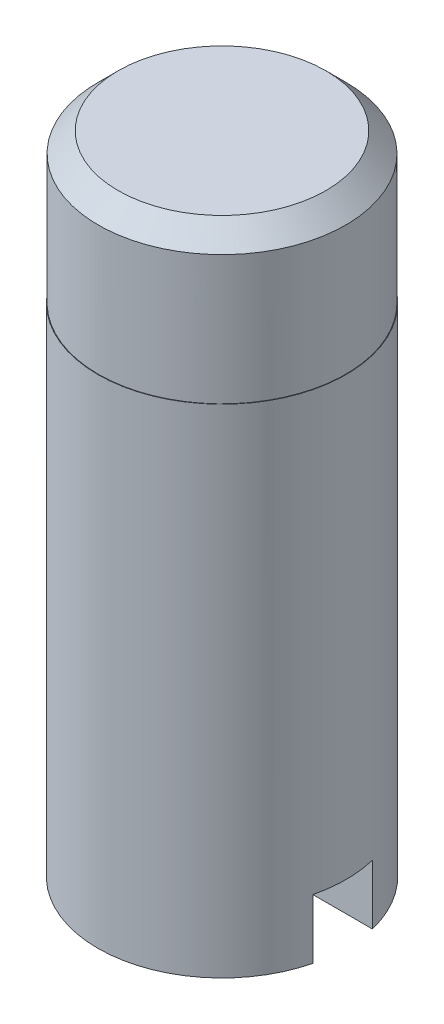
ISO-10303-21;
HEADER;
FILE_DESCRIPTION(('STEP AP214'),'2;1');
FILE_NAME('part.step','',(''),(''),'','','');
FILE_SCHEMA(('AUTOMOTIVE_DESIGN { 1 0 10303 214 1 1 1 1 }'));
ENDSEC;
DATA;
#1=APPLICATION_CONTEXT('core data for automotive mechanical design processes');
#2=APPLICATION_PROTOCOL_DEFINITION('international standard','automotive_design',2000,#1);
#3=PRODUCT_CONTEXT('',#1,'mechanical');
#4=PRODUCT('Part','Part','',(#3));
#5=PRODUCT_RELATED_PRODUCT_CATEGORY('part','',(#4));
#6=PRODUCT_DEFINITION_FORMATION('','',#4);
#7=PRODUCT_DEFINITION_CONTEXT('part definition',#1,'design');
#8=PRODUCT_DEFINITION('design','',#6,#7);
#9=PRODUCT_DEFINITION_SHAPE('','',#8);
#10=(LENGTH_UNIT() NAMED_UNIT(*) SI_UNIT(.MILLI.,.METRE.));
#11=(NAMED_UNIT(*) PLANE_ANGLE_UNIT() SI_UNIT($,.RADIAN.));
#12=(NAMED_UNIT(*) SI_UNIT($,.STERADIAN.) SOLID_ANGLE_UNIT());
#13=UNCERTAINTY_MEASURE_WITH_UNIT(LENGTH_MEASURE(1.E-05),#10,'distance_accuracy_value','');
#14=(GEOMETRIC_REPRESENTATION_CONTEXT(3) GLOBAL_UNCERTAINTY_ASSIGNED_CONTEXT((#13)) GLOBAL_UNIT_ASSIGNED_CONTEXT((#10,
#11,#12)) REPRESENTATION_CONTEXT('',''));
#15=CARTESIAN_POINT('',(0.,0.,0.));
#16=DIRECTION('',(0.,0.,1.));
#17=DIRECTION('',(1.,0.,0.));
#18=AXIS2_PLACEMENT_3D('',#15,#16,#17);
#19=CARTESIAN_POINT('',(0.,0.,0.));
#20=DIRECTION('',(0.,1.,0.));
#21=DIRECTION('',(0.,0.,1.));
#22=AXIS2_PLACEMENT_3D('',#19,#20,#21);
#23=PLANE('',#22);
#24=CARTESIAN_POINT('',(0.,0.,0.));
#25=DIRECTION('',(0.,1.,0.));
#26=DIRECTION('',(0.,0.,1.));
#27=AXIS2_PLACEMENT_3D('',#24,#25,#26);
#28=CIRCLE('',#27,2.5);
#29=CARTESIAN_POINT('',(-2.42693221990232,0.,0.6));
#30=VERTEX_POINT('',#29);
#31=CARTESIAN_POINT('',(2.42693221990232,0.,0.6));
#32=VERTEX_POINT('',#31);
#33=EDGE_CURVE('E93',#30,#32,#28,.T.);
#34=ORIENTED_EDGE('',*,*,#33,.F.);
#35=DIRECTION('',(1.,0.,0.));
#36=VECTOR('',#35,1.);
#37=CARTESIAN_POINT('',(0.,0.,0.6));
#38=LINE('',#37,#36);
#39=EDGE_CURVE('E80',#30,#32,#38,.T.);
#40=ORIENTED_EDGE('',*,*,#39,.T.);
#41=EDGE_LOOP('',(#34,#40));
#42=FACE_BOUND('',#41,.T.);
#43=ADVANCED_FACE('F32',(#42),#23,.F.);
#44=CARTESIAN_POINT('',(0.,10.,0.));
#45=DIRECTION('',(0.,1.,0.));
#46=DIRECTION('',(0.,0.,1.));
#47=AXIS2_PLACEMENT_3D('',#44,#45,#46);
#48=PLANE('',#47);
#49=CARTESIAN_POINT('',(0.,10.,0.));
#50=DIRECTION('',(0.,1.,0.));
#51=DIRECTION('',(0.,0.,1.));
#52=AXIS2_PLACEMENT_3D('',#49,#50,#51);
#53=CIRCLE('',#52,2.5);
#54=CARTESIAN_POINT('',(0.,10.,2.5));
#55=VERTEX_POINT('',#54);
#56=EDGE_CURVE('E81',#55,#55,#53,.T.);
#57=ORIENTED_EDGE('',*,*,#56,.T.);
#58=EDGE_LOOP('',(#57));
#59=FACE_BOUND('',#58,.T.);
#60=CARTESIAN_POINT('',(0.,10.,0.));
#61=DIRECTION('',(0.,1.,0.));
#62=DIRECTION('',(0.,0.,1.));
#63=AXIS2_PLACEMENT_3D('',#60,#61,#62);
#64=CIRCLE('',#63,2.49);
#65=CARTESIAN_POINT('',(0.,10.,2.49));
#66=VERTEX_POINT('',#65);
#67=EDGE_CURVE('E97',#66,#66,#64,.T.);
#68=ORIENTED_EDGE('',*,*,#67,.F.);
#69=EDGE_LOOP('',(#68));
#70=FACE_BOUND('',#69,.T.);
#71=ADVANCED_FACE('F120',(#59,#70),#48,.T.);
#72=CARTESIAN_POINT('',(0.,10.,0.));
#73=DIRECTION('',(0.,-1.,0.));
#74=DIRECTION('',(0.,0.,-1.));
#75=AXIS2_PLACEMENT_3D('',#72,#73,#74);
#76=CYLINDRICAL_SURFACE('',#75,2.5);
#77=ORIENTED_EDGE('',*,*,#33,.T.);
#78=DIRECTION('',(0.,-1.,0.));
#79=VECTOR('',#78,1.);
#80=CARTESIAN_POINT('',(2.42693221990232,10.,0.6));
#81=LINE('',#80,#79);
#82=CARTESIAN_POINT('',(2.42693221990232,1.2,0.6));
#83=VERTEX_POINT('',#82);
#84=EDGE_CURVE('E90',#32,#83,#81,.F.);
#85=ORIENTED_EDGE('',*,*,#84,.T.);
#86=CARTESIAN_POINT('',(0.,1.2,0.));
#87=DIRECTION('',(0.,-1.,0.));
#88=DIRECTION('',(0.,0.,-1.));
#89=AXIS2_PLACEMENT_3D('',#86,#87,#88);
#90=CIRCLE('',#89,2.5);
#91=CARTESIAN_POINT('',(2.42693221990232,1.2,-0.6));
#92=VERTEX_POINT('',#91);
#93=EDGE_CURVE('E89',#92,#83,#90,.T.);
#94=ORIENTED_EDGE('',*,*,#93,.F.);
#95=DIRECTION('',(0.,-1.,0.));
#96=VECTOR('',#95,1.);
#97=CARTESIAN_POINT('',(2.42693221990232,10.,-0.6));
#98=LINE('',#97,#96);
#99=CARTESIAN_POINT('',(2.42693221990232,0.,-0.6));
#100=VERTEX_POINT('',#99);
#101=EDGE_CURVE('E75',#92,#100,#98,.T.);
#102=ORIENTED_EDGE('',*,*,#101,.T.);
#103=CARTESIAN_POINT('',(-2.42693221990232,0.,-0.6));
#104=VERTEX_POINT('',#103);
#105=EDGE_CURVE('E87',#100,#104,#28,.T.);
#106=ORIENTED_EDGE('',*,*,#105,.T.);
#107=DIRECTION('',(0.,-1.,0.));
#108=VECTOR('',#107,1.);
#109=CARTESIAN_POINT('',(-2.42693221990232,10.,-0.6));
#110=LINE('',#109,#108);
#111=CARTESIAN_POINT('',(-2.42693221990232,1.2,-0.6));
#112=VERTEX_POINT('',#111);
#113=EDGE_CURVE('E47',#104,#112,#110,.F.);
#114=ORIENTED_EDGE('',*,*,#113,.T.);
#115=CARTESIAN_POINT('',(-2.42693221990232,1.2,0.6));
#116=VERTEX_POINT('',#115);
#117=EDGE_CURVE('E103',#116,#112,#90,.T.);
#118=ORIENTED_EDGE('',*,*,#117,.F.);
#119=DIRECTION('',(0.,-1.,0.));
#120=VECTOR('',#119,1.);
#121=CARTESIAN_POINT('',(-2.42693221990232,10.,0.6));
#122=LINE('',#121,#120);
#123=EDGE_CURVE('E55',#116,#30,#122,.T.);
#124=ORIENTED_EDGE('',*,*,#123,.T.);
#125=EDGE_LOOP('',(#77,#85,#94,#102,#106,#114,#118,#124));
#126=FACE_BOUND('',#125,.T.);
#127=ORIENTED_EDGE('',*,*,#56,.F.);
#128=EDGE_LOOP('',(#127));
#129=FACE_BOUND('',#128,.T.);
#130=ADVANCED_FACE('F34',(#126,#129),#76,.T.);
#131=ORIENTED_EDGE('',*,*,#105,.F.);
#132=DIRECTION('',(-1.,0.,0.));
#133=VECTOR('',#132,1.);
#134=CARTESIAN_POINT('',(0.,0.,-0.6));
#135=LINE('',#134,#133);
#136=EDGE_CURVE('E72',#100,#104,#135,.T.);
#137=ORIENTED_EDGE('',*,*,#136,.T.);
#138=EDGE_LOOP('',(#131,#137));
#139=FACE_BOUND('',#138,.T.);
#140=ADVANCED_FACE('F92',(#139),#23,.F.);
#141=CARTESIAN_POINT('',(0.,13.,0.));
#142=DIRECTION('',(0.,-1.,0.));
#143=DIRECTION('',(0.,0.,-1.));
#144=AXIS2_PLACEMENT_3D('',#141,#142,#143);
#145=CYLINDRICAL_SURFACE('',#144,2.49);
#146=CARTESIAN_POINT('',(0.,12.6,0.));
#147=DIRECTION('',(0.,1.,0.));
#148=DIRECTION('',(0.,0.,1.));
#149=AXIS2_PLACEMENT_3D('',#146,#147,#148);
#150=CIRCLE('',#149,2.49);
#151=CARTESIAN_POINT('',(0.,12.6,-2.49));
#152=VERTEX_POINT('',#151);
#153=EDGE_CURVE('E11',#152,#152,#150,.F.);
#154=ORIENTED_EDGE('',*,*,#153,.T.);
#155=EDGE_LOOP('',(#154));
#156=FACE_BOUND('',#155,.T.);
#157=ORIENTED_EDGE('',*,*,#67,.T.);
#158=EDGE_LOOP('',(#157));
#159=FACE_BOUND('',#158,.T.);
#160=ADVANCED_FACE('F128',(#156,#159),#145,.T.);
#161=CARTESIAN_POINT('',(0.,13.,0.));
#162=DIRECTION('',(0.,1.,0.));
#163=DIRECTION('',(0.,0.,1.));
#164=AXIS2_PLACEMENT_3D('',#161,#162,#163);
#165=PLANE('',#164);
#166=CARTESIAN_POINT('',(0.,13.,0.));
#167=DIRECTION('',(0.,1.,0.));
#168=DIRECTION('',(0.,0.,1.));
#169=AXIS2_PLACEMENT_3D('',#166,#167,#168);
#170=CIRCLE('',#169,2.09);
#171=CARTESIAN_POINT('',(0.,13.,-2.09));
#172=VERTEX_POINT('',#171);
#173=EDGE_CURVE('E40',#172,#172,#170,.T.);
#174=ORIENTED_EDGE('',*,*,#173,.T.);
#175=EDGE_LOOP('',(#174));
#176=FACE_BOUND('',#175,.T.);
#177=ADVANCED_FACE('F133',(#176),#165,.T.);
#178=CARTESIAN_POINT('',(-6.07180887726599,1.2,-0.6));
#179=DIRECTION('',(0.,-1.,0.));
#180=DIRECTION('',(0.,0.,-1.));
#181=AXIS2_PLACEMENT_3D('',#178,#179,#180);
#182=PLANE('',#181);
#183=ORIENTED_EDGE('',*,*,#93,.T.);
#184=DIRECTION('',(-1.,0.,0.));
#185=VECTOR('',#184,1.);
#186=CARTESIAN_POINT('',(-6.07180887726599,1.2,0.6));
#187=LINE('',#186,#185);
#188=EDGE_CURVE('E109',#83,#116,#187,.T.);
#189=ORIENTED_EDGE('',*,*,#188,.T.);
#190=ORIENTED_EDGE('',*,*,#117,.T.);
#191=DIRECTION('',(1.,0.,0.));
#192=VECTOR('',#191,1.);
#193=CARTESIAN_POINT('',(-6.07180887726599,1.2,-0.6));
#194=LINE('',#193,#192);
#195=EDGE_CURVE('E111',#112,#92,#194,.T.);
#196=ORIENTED_EDGE('',*,*,#195,.T.);
#197=EDGE_LOOP('',(#183,#189,#190,#196));
#198=FACE_BOUND('',#197,.T.);
#199=ADVANCED_FACE('F108',(#198),#182,.T.);
#200=CARTESIAN_POINT('',(-6.07180887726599,1.2,0.6));
#201=DIRECTION('',(0.,0.,1.));
#202=DIRECTION('',(1.,0.,0.));
#203=AXIS2_PLACEMENT_3D('',#200,#201,#202);
#204=PLANE('',#203);
#205=ORIENTED_EDGE('',*,*,#188,.F.);
#206=ORIENTED_EDGE('',*,*,#84,.F.);
#207=ORIENTED_EDGE('',*,*,#39,.F.);
#208=ORIENTED_EDGE('',*,*,#123,.F.);
#209=EDGE_LOOP('',(#205,#206,#207,#208));
#210=FACE_BOUND('',#209,.T.);
#211=ADVANCED_FACE('F112',(#210),#204,.F.);
#212=CARTESIAN_POINT('',(-6.07180887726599,1.2,-0.6));
#213=DIRECTION('',(0.,0.,-1.));
#214=DIRECTION('',(-1.,0.,0.));
#215=AXIS2_PLACEMENT_3D('',#212,#213,#214);
#216=PLANE('',#215);
#217=ORIENTED_EDGE('',*,*,#195,.F.);
#218=ORIENTED_EDGE('',*,*,#113,.F.);
#219=ORIENTED_EDGE('',*,*,#136,.F.);
#220=ORIENTED_EDGE('',*,*,#101,.F.);
#221=EDGE_LOOP('',(#217,#218,#219,#220));
#222=FACE_BOUND('',#221,.T.);
#223=ADVANCED_FACE('F74',(#222),#216,.F.);
#224=CARTESIAN_POINT('',(0.,13.,0.));
#225=DIRECTION('',(0.,-1.,0.));
#226=DIRECTION('',(0.,0.,-1.));
#227=AXIS2_PLACEMENT_3D('',#224,#225,#226);
#228=CONICAL_SURFACE('',#227,2.09,0.785398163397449);
#229=CARTESIAN_POINT('',(0.,12.6,-2.49));
#230=CARTESIAN_POINT('',(0.,12.6041666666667,-2.48583333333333));
#231=CARTESIAN_POINT('',(0.,12.6083333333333,-2.48166666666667));
#232=CARTESIAN_POINT('',(0.,12.6166666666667,-2.47333333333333));
#233=CARTESIAN_POINT('',(0.,12.6208333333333,-2.46916666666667));
#234=CARTESIAN_POINT('',(0.,12.6291666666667,-2.46083333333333));
#235=CARTESIAN_POINT('',(0.,12.6333333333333,-2.45666666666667));
#236=CARTESIAN_POINT('',(0.,12.6416666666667,-2.44833333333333));
#237=CARTESIAN_POINT('',(0.,12.6458333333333,-2.44416666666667));
#238=CARTESIAN_POINT('',(0.,12.6541666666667,-2.43583333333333));
#239=CARTESIAN_POINT('',(0.,12.6583333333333,-2.43166666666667));
#240=CARTESIAN_POINT('',(0.,12.6666666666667,-2.42333333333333));
#241=CARTESIAN_POINT('',(0.,12.6708333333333,-2.41916666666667));
#242=CARTESIAN_POINT('',(0.,12.6791666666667,-2.41083333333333));
#243=CARTESIAN_POINT('',(0.,12.6833333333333,-2.40666666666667));
#244=CARTESIAN_POINT('',(0.,12.6916666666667,-2.39833333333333));
#245=CARTESIAN_POINT('',(0.,12.6958333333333,-2.39416666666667));
#246=CARTESIAN_POINT('',(0.,12.7041666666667,-2.38583333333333));
#247=CARTESIAN_POINT('',(0.,12.7083333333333,-2.38166666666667));
#248=CARTESIAN_POINT('',(0.,12.7166666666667,-2.37333333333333));
#249=CARTESIAN_POINT('',(0.,12.7208333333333,-2.36916666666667));
#250=CARTESIAN_POINT('',(0.,12.7291666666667,-2.36083333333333));
#251=CARTESIAN_POINT('',(0.,12.7333333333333,-2.35666666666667));
#252=CARTESIAN_POINT('',(0.,12.7416666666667,-2.34833333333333));
#253=CARTESIAN_POINT('',(0.,12.7458333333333,-2.34416666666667));
#254=CARTESIAN_POINT('',(0.,12.7541666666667,-2.33583333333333));
#255=CARTESIAN_POINT('',(0.,12.7583333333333,-2.33166666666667));
#256=CARTESIAN_POINT('',(0.,12.7666666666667,-2.32333333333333));
#257=CARTESIAN_POINT('',(0.,12.7708333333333,-2.31916666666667));
#258=CARTESIAN_POINT('',(0.,12.7791666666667,-2.31083333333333));
#259=CARTESIAN_POINT('',(0.,12.7833333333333,-2.30666666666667));
#260=CARTESIAN_POINT('',(0.,12.7916666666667,-2.29833333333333));
#261=CARTESIAN_POINT('',(0.,12.7958333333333,-2.29416666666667));
#262=CARTESIAN_POINT('',(0.,12.8041666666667,-2.28583333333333));
#263=CARTESIAN_POINT('',(0.,12.8083333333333,-2.28166666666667));
#264=CARTESIAN_POINT('',(0.,12.8166666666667,-2.27333333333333));
#265=CARTESIAN_POINT('',(0.,12.8208333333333,-2.26916666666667));
#266=CARTESIAN_POINT('',(0.,12.8291666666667,-2.26083333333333));
#267=CARTESIAN_POINT('',(0.,12.8333333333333,-2.25666666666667));
#268=CARTESIAN_POINT('',(0.,12.8416666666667,-2.24833333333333));
#269=CARTESIAN_POINT('',(0.,12.8458333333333,-2.24416666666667));
#270=CARTESIAN_POINT('',(0.,12.8541666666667,-2.23583333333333));
#271=CARTESIAN_POINT('',(0.,12.8583333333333,-2.23166666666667));
#272=CARTESIAN_POINT('',(0.,12.8666666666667,-2.22333333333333));
#273=CARTESIAN_POINT('',(0.,12.8708333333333,-2.21916666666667));
#274=CARTESIAN_POINT('',(0.,12.8791666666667,-2.21083333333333));
#275=CARTESIAN_POINT('',(0.,12.8833333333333,-2.20666666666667));
#276=CARTESIAN_POINT('',(0.,12.8916666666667,-2.19833333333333));
#277=CARTESIAN_POINT('',(0.,12.8958333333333,-2.19416666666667));
#278=CARTESIAN_POINT('',(0.,12.9041666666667,-2.18583333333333));
#279=CARTESIAN_POINT('',(0.,12.9083333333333,-2.18166666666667));
#280=CARTESIAN_POINT('',(0.,12.9166666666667,-2.17333333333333));
#281=CARTESIAN_POINT('',(0.,12.9208333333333,-2.16916666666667));
#282=CARTESIAN_POINT('',(0.,12.9291666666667,-2.16083333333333));
#283=CARTESIAN_POINT('',(0.,12.9333333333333,-2.15666666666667));
#284=CARTESIAN_POINT('',(0.,12.9416666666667,-2.14833333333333));
#285=CARTESIAN_POINT('',(0.,12.9458333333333,-2.14416666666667));
#286=CARTESIAN_POINT('',(0.,12.9541666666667,-2.13583333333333));
#287=CARTESIAN_POINT('',(0.,12.9583333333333,-2.13166666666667));
#288=CARTESIAN_POINT('',(0.,12.9666666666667,-2.12333333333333));
#289=CARTESIAN_POINT('',(0.,12.9708333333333,-2.11916666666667));
#290=CARTESIAN_POINT('',(0.,12.9791666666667,-2.11083333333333));
#291=CARTESIAN_POINT('',(0.,12.9833333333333,-2.10666666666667));
#292=CARTESIAN_POINT('',(0.,12.9916666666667,-2.09833333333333));
#293=CARTESIAN_POINT('',(0.,12.9958333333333,-2.09416666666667));
#294=CARTESIAN_POINT('',(0.,13.,-2.09));
#295=B_SPLINE_CURVE_WITH_KNOTS('',3,(#229,#230,#231,#232,#233,#234,#235,#236,#237,#238,#239,
#240,#241,#242,#243,#244,#245,#246,#247,#248,#249,#250,#251,#252,#253,#254,#255,#256,#257,#258,
#259,#260,#261,#262,#263,#264,#265,#266,#267,#268,#269,#270,#271,#272,#273,#274,#275,#276,#277,
#278,#279,#280,#281,#282,#283,#284,#285,#286,#287,#288,#289,#290,#291,#292,#293,#294),
.UNSPECIFIED.,.F.,.F.,(4,2,2,2,2,2,2,2,2,2,2,2,2,2,2,2,2,2,2,2,2,2,2,2,2,2,2,2,2,2,2,2,4),(0.,
0.0176776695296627,0.0353553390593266,0.0530330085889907,0.0707106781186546,0.0883883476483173,
0.106066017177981,0.123743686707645,0.141421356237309,0.159099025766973,0.176776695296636,
0.1944543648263,0.212132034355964,0.229809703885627,0.24748737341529,0.265165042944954,
0.282842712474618,0.300520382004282,0.318198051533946,0.335875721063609,0.353553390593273,
0.371231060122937,0.3889087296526,0.406586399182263,0.424264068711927,0.441941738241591,
0.459619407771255,0.477297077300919,0.494974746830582,0.512652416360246,0.53033008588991,
0.548007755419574,0.565685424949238),.UNSPECIFIED.);
#296=EDGE_CURVE('BSEAM175',#152,#172,#295,.T.);
#297=ORIENTED_EDGE('',*,*,#153,.F.);
#298=ORIENTED_EDGE('',*,*,#173,.F.);
#299=ORIENTED_EDGE('',*,*,#296,.T.);
#300=ORIENTED_EDGE('',*,*,#296,.F.);
#301=EDGE_LOOP('',(#297,#299,#298,#300));
#302=FACE_BOUND('',#301,.T.);
#303=ADVANCED_FACE('F175',(#302),#228,.T.);
#304=CLOSED_SHELL('',(#43,#71,#130,#140,#160,#177,#199,#211,#223,#303));
#305=MANIFOLD_SOLID_BREP('B2',#304);
#306=ADVANCED_BREP_SHAPE_REPRESENTATION('',(#18,#305),#14);
#307=SHAPE_DEFINITION_REPRESENTATION(#9,#306);
ENDSEC;
END-ISO-10303-21;
